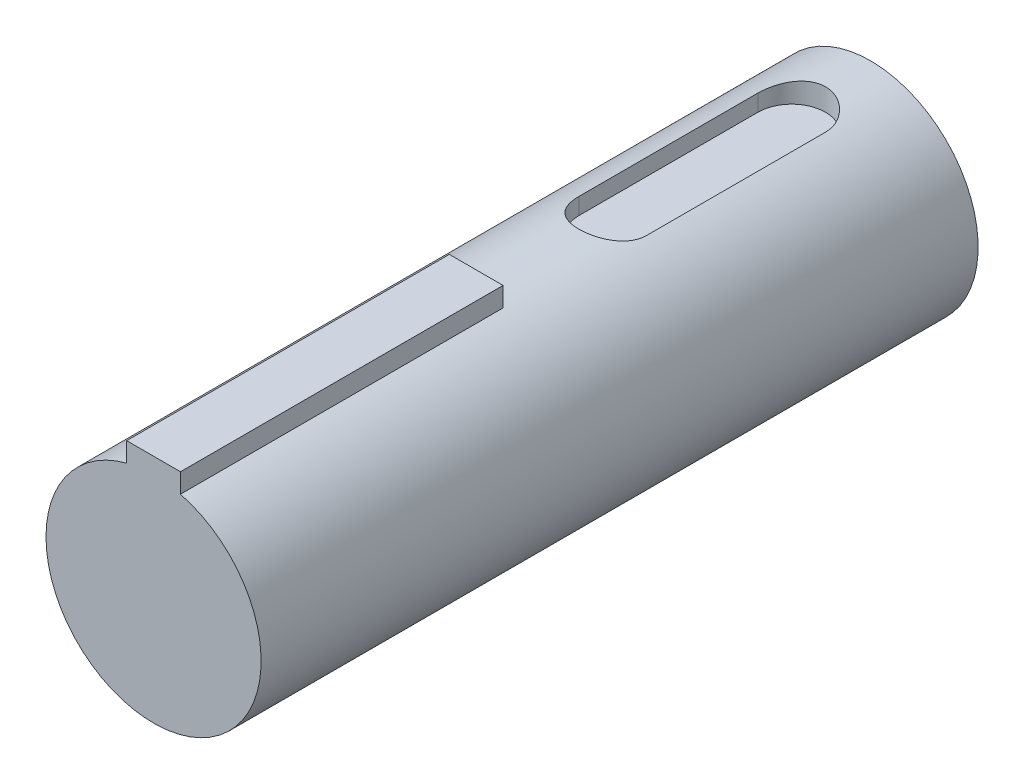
ISO-10303-21;
HEADER;
FILE_DESCRIPTION(('STEP AP214'),'2;1');
FILE_NAME('part.step','',(''),(''),'','','');
FILE_SCHEMA(('AUTOMOTIVE_DESIGN { 1 0 10303 214 1 1 1 1 }'));
ENDSEC;
DATA;
#1=APPLICATION_CONTEXT('core data for automotive mechanical design processes');
#2=APPLICATION_PROTOCOL_DEFINITION('international standard','automotive_design',2000,#1);
#3=PRODUCT_CONTEXT('',#1,'mechanical');
#4=PRODUCT('Part','Part','',(#3));
#5=PRODUCT_RELATED_PRODUCT_CATEGORY('part','',(#4));
#6=PRODUCT_DEFINITION_FORMATION('','',#4);
#7=PRODUCT_DEFINITION_CONTEXT('part definition',#1,'design');
#8=PRODUCT_DEFINITION('design','',#6,#7);
#9=PRODUCT_DEFINITION_SHAPE('','',#8);
#10=(LENGTH_UNIT() NAMED_UNIT(*) SI_UNIT(.MILLI.,.METRE.));
#11=(NAMED_UNIT(*) PLANE_ANGLE_UNIT() SI_UNIT($,.RADIAN.));
#12=(NAMED_UNIT(*) SI_UNIT($,.STERADIAN.) SOLID_ANGLE_UNIT());
#13=UNCERTAINTY_MEASURE_WITH_UNIT(LENGTH_MEASURE(1.E-05),#10,'distance_accuracy_value','');
#14=(GEOMETRIC_REPRESENTATION_CONTEXT(3) GLOBAL_UNCERTAINTY_ASSIGNED_CONTEXT((#13)) GLOBAL_UNIT_ASSIGNED_CONTEXT((#10,
#11,#12)) REPRESENTATION_CONTEXT('',''));
#15=CARTESIAN_POINT('',(0.,0.,0.));
#16=DIRECTION('',(0.,0.,1.));
#17=DIRECTION('',(1.,0.,0.));
#18=AXIS2_PLACEMENT_3D('',#15,#16,#17);
#19=CARTESIAN_POINT('',(0.,0.,28.575));
#20=DIRECTION('',(0.,0.,-1.));
#21=DIRECTION('',(-1.,0.,0.));
#22=AXIS2_PLACEMENT_3D('',#19,#20,#21);
#23=CYLINDRICAL_SURFACE('',#22,9.525);
#24=CARTESIAN_POINT('',(0.,0.,-34.925));
#25=DIRECTION('',(0.,0.,-1.));
#26=DIRECTION('',(-1.,0.,0.));
#27=AXIS2_PLACEMENT_3D('',#24,#25,#26);
#28=CIRCLE('',#27,9.525);
#29=CARTESIAN_POINT('',(-9.525,0.,-34.925));
#30=VERTEX_POINT('',#29);
#31=EDGE_CURVE('E162',#30,#30,#28,.T.);
#32=ORIENTED_EDGE('',*,*,#31,.F.);
#33=EDGE_LOOP('',(#32));
#34=FACE_BOUND('',#33,.T.);
#35=DIRECTION('',(0.,0.,-1.));
#36=VECTOR('',#35,1.);
#37=CARTESIAN_POINT('',(-2.38125,9.22254159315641,28.575));
#38=LINE('',#37,#36);
#39=CARTESIAN_POINT('',(-2.38125,9.22254159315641,28.575));
#40=VERTEX_POINT('',#39);
#41=CARTESIAN_POINT('',(-2.38125,9.22254159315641,0.));
#42=VERTEX_POINT('',#41);
#43=EDGE_CURVE('E180',#40,#42,#38,.T.);
#44=ORIENTED_EDGE('',*,*,#43,.T.);
#45=CARTESIAN_POINT('',(0.,0.,0.));
#46=DIRECTION('',(0.,0.,-1.));
#47=DIRECTION('',(-1.,0.,0.));
#48=AXIS2_PLACEMENT_3D('',#45,#46,#47);
#49=CIRCLE('',#48,9.525);
#50=CARTESIAN_POINT('',(2.38125,9.22254159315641,0.));
#51=VERTEX_POINT('',#50);
#52=EDGE_CURVE('E132',#42,#51,#49,.T.);
#53=ORIENTED_EDGE('',*,*,#52,.T.);
#54=DIRECTION('',(0.,0.,-1.));
#55=VECTOR('',#54,1.);
#56=CARTESIAN_POINT('',(2.38125,9.22254159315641,28.575));
#57=LINE('',#56,#55);
#58=CARTESIAN_POINT('',(2.38125,9.22254159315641,28.575));
#59=VERTEX_POINT('',#58);
#60=EDGE_CURVE('E197',#59,#51,#57,.T.);
#61=ORIENTED_EDGE('',*,*,#60,.F.);
#62=CARTESIAN_POINT('',(0.,0.,28.575));
#63=DIRECTION('',(0.,0.,1.));
#64=DIRECTION('',(1.,0.,0.));
#65=AXIS2_PLACEMENT_3D('',#62,#63,#64);
#66=CIRCLE('',#65,9.525);
#67=EDGE_CURVE('E169',#40,#59,#66,.T.);
#68=ORIENTED_EDGE('',*,*,#67,.F.);
#69=EDGE_LOOP('',(#44,#53,#61,#68));
#70=FACE_BOUND('',#69,.T.);
#71=CARTESIAN_POINT('',(2.9972,9.041151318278,-27.94));
#72=CARTESIAN_POINT('',(2.99721048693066,9.04113917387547,-28.0220512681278));
#73=CARTESIAN_POINT('',(2.99383086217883,9.04226799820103,-28.1040956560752));
#74=CARTESIAN_POINT('',(2.9803730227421,9.04671726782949,-28.2675539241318));
#75=CARTESIAN_POINT('',(2.97029644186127,9.05003717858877,-28.348967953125));
#76=CARTESIAN_POINT('',(2.94356252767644,9.05876654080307,-28.5103703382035));
#77=CARTESIAN_POINT('',(2.9269231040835,9.06417030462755,-28.5903619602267));
#78=CARTESIAN_POINT('',(2.88722986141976,9.07689155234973,-28.7485611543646));
#79=CARTESIAN_POINT('',(2.86417584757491,9.08420909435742,-28.8267686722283));
#80=CARTESIAN_POINT('',(2.78568484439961,9.10871154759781,-29.0578382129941));
#81=CARTESIAN_POINT('',(2.72088210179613,9.12845907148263,-29.2073668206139));
#82=CARTESIAN_POINT('',(2.56834119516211,9.17254136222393,-29.4934395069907));
#83=CARTESIAN_POINT('',(2.48059089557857,9.19687855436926,-29.6299766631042));
#84=CARTESIAN_POINT('',(2.28137707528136,9.24834222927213,-29.8909733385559));
#85=CARTESIAN_POINT('',(2.16925559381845,9.27553229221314,-30.0149191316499));
#86=CARTESIAN_POINT('',(1.92588986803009,9.32909841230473,-30.2425932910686));
#87=CARTESIAN_POINT('',(1.79464232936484,9.35547432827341,-30.3463181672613));
#88=CARTESIAN_POINT('',(1.51302443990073,9.40517197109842,-30.5329003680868));
#89=CARTESIAN_POINT('',(1.36228410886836,9.42840963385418,-30.6152236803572));
#90=CARTESIAN_POINT('',(1.04824759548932,9.46846410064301,-30.7531429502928));
#91=CARTESIAN_POINT('',(0.884954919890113,9.48528269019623,-30.8087463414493));
#92=CARTESIAN_POINT('',(0.555861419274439,9.51015297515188,-30.8899226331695));
#93=CARTESIAN_POINT('',(0.390298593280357,9.51846230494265,-30.9163800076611));
#94=CARTESIAN_POINT('',(0.0568858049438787,9.52628831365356,-30.9413166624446));
#95=CARTESIAN_POINT('',(-0.110963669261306,9.5258068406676,-30.9398018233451));
#96=CARTESIAN_POINT('',(-0.437950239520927,9.51628404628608,-30.9094157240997));
#97=CARTESIAN_POINT('',(-0.597186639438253,9.50754294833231,-30.881503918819));
#98=CARTESIAN_POINT('',(-0.908586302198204,9.48285325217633,-30.800692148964));
#99=CARTESIAN_POINT('',(-1.06074918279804,9.46690426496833,-30.747790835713));
#100=CARTESIAN_POINT('',(-1.35588769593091,9.42918977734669,-30.6178906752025));
#101=CARTESIAN_POINT('',(-1.49872666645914,9.40735487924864,-30.5406023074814));
#102=CARTESIAN_POINT('',(-1.76970329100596,9.36016668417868,-30.3643551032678));
#103=CARTESIAN_POINT('',(-1.89783732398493,9.33481252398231,-30.2653909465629));
#104=CARTESIAN_POINT('',(-2.14147672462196,9.28202044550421,-30.0436969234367));
#105=CARTESIAN_POINT('',(-2.25622246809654,9.25453974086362,-29.9201413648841));
#106=CARTESIAN_POINT('',(-2.46361511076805,9.20150624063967,-29.6552563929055));
#107=CARTESIAN_POINT('',(-2.55625530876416,9.17595403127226,-29.5139216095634));
#108=CARTESIAN_POINT('',(-2.71772114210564,9.12944610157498,-29.2152902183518));
#109=CARTESIAN_POINT('',(-2.78624804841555,9.10854914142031,-29.057822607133));
#110=CARTESIAN_POINT('',(-2.89549150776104,9.07441913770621,-28.7328493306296));
#111=CARTESIAN_POINT('',(-2.93625111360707,9.06117423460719,-28.5653596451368));
#112=CARTESIAN_POINT('',(-2.97396683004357,9.04882670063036,-28.3202271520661));
#113=CARTESIAN_POINT('',(-2.9826772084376,9.045955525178,-28.244420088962));
#114=CARTESIAN_POINT('',(-2.99428915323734,9.04211715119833,-28.0924217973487));
#115=CARTESIAN_POINT('',(-2.9971988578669,9.04114728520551,-28.0162312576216));
#116=CARTESIAN_POINT('',(-2.9972,9.041151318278,-27.94));
#117=B_SPLINE_CURVE_WITH_KNOTS('',3,(#71,#72,#73,#74,#75,#76,#77,#78,#79,#80,#81,#82,#83,#84,
#85,#86,#87,#88,#89,#90,#91,#92,#93,#94,#95,#96,#97,#98,#99,#100,#101,#102,#103,#104,#105,#106,
#107,#108,#109,#110,#111,#112,#113,#114,#115,#116),.UNSPECIFIED.,.F.,.F.,(4,2,2,2,2,2,2,2,2,2,2,
2,2,2,2,2,2,2,2,2,2,2,4),(0.,0.246064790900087,0.492069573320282,0.737407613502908,
0.98275310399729,1.47278341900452,1.963073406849,2.46875537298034,2.97452454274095,
3.49191038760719,4.00915221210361,4.51022397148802,5.01119039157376,5.49462071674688,
5.978077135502,6.4675039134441,6.95705095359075,7.46722571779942,7.97755494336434,
8.49400055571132,9.00964359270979,9.23851681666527,9.46706870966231),.UNSPECIFIED.);
#118=CARTESIAN_POINT('',(2.9972,9.04115131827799,-27.94));
#119=VERTEX_POINT('',#118);
#120=CARTESIAN_POINT('',(-2.9972,9.04115131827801,-27.94));
#121=VERTEX_POINT('',#120);
#122=EDGE_CURVE('E11',#119,#121,#117,.T.);
#123=ORIENTED_EDGE('',*,*,#122,.F.);
#124=DIRECTION('',(0.,0.,-1.));
#125=VECTOR('',#124,1.);
#126=CARTESIAN_POINT('',(2.99720000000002,9.04115131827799,28.575));
#127=LINE('',#126,#125);
#128=CARTESIAN_POINT('',(2.99720000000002,9.04115131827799,-12.0904));
#129=VERTEX_POINT('',#128);
#130=EDGE_CURVE('E200',#129,#119,#127,.T.);
#131=ORIENTED_EDGE('',*,*,#130,.F.);
#132=CARTESIAN_POINT('',(-2.99719999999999,9.041151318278,-12.0904));
#133=CARTESIAN_POINT('',(-2.99721048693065,9.04113917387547,-12.0083487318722));
#134=CARTESIAN_POINT('',(-2.99383086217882,9.04226799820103,-11.9263043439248));
#135=CARTESIAN_POINT('',(-2.98037302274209,9.04671726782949,-11.7628460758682));
#136=CARTESIAN_POINT('',(-2.97029644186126,9.05003717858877,-11.681432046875));
#137=CARTESIAN_POINT('',(-2.94356252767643,9.05876654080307,-11.5200296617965));
#138=CARTESIAN_POINT('',(-2.92692310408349,9.06417030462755,-11.4400380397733));
#139=CARTESIAN_POINT('',(-2.88722986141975,9.07689155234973,-11.2818388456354));
#140=CARTESIAN_POINT('',(-2.8641758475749,9.08420909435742,-11.2036313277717));
#141=CARTESIAN_POINT('',(-2.7856848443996,9.10871154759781,-10.9725617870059));
#142=CARTESIAN_POINT('',(-2.72088210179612,9.12845907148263,-10.8230331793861));
#143=CARTESIAN_POINT('',(-2.5683411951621,9.17254136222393,-10.5369604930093));
#144=CARTESIAN_POINT('',(-2.48059089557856,9.19687855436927,-10.4004233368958));
#145=CARTESIAN_POINT('',(-2.28137707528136,9.24834222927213,-10.1394266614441));
#146=CARTESIAN_POINT('',(-2.16925559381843,9.27553229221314,-10.0154808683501));
#147=CARTESIAN_POINT('',(-1.92588986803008,9.32909841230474,-9.78780670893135));
#148=CARTESIAN_POINT('',(-1.79464232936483,9.35547432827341,-9.6840818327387));
#149=CARTESIAN_POINT('',(-1.51302443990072,9.40517197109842,-9.49749963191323));
#150=CARTESIAN_POINT('',(-1.36228410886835,9.42840963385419,-9.41517631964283));
#151=CARTESIAN_POINT('',(-1.04824759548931,9.46846410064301,-9.27725704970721));
#152=CARTESIAN_POINT('',(-0.8849549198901,9.48528269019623,-9.22165365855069));
#153=CARTESIAN_POINT('',(-0.555861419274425,9.51015297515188,-9.14047736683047));
#154=CARTESIAN_POINT('',(-0.390298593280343,9.51846230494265,-9.11401999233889));
#155=CARTESIAN_POINT('',(-0.0568858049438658,9.52628831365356,-9.08908333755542));
#156=CARTESIAN_POINT('',(0.110963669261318,9.5258068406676,-9.0905981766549));
#157=CARTESIAN_POINT('',(0.437950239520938,9.51628404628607,-9.12098427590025));
#158=CARTESIAN_POINT('',(0.597186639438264,9.50754294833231,-9.14889608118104));
#159=CARTESIAN_POINT('',(0.908586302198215,9.48285325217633,-9.229707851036));
#160=CARTESIAN_POINT('',(1.06074918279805,9.46690426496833,-9.28260916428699));
#161=CARTESIAN_POINT('',(1.35588769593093,9.42918977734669,-9.41250932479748));
#162=CARTESIAN_POINT('',(1.49872666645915,9.40735487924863,-9.48979769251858));
#163=CARTESIAN_POINT('',(1.76970329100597,9.36016668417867,-9.66604489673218));
#164=CARTESIAN_POINT('',(1.89783732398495,9.33481252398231,-9.76500905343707));
#165=CARTESIAN_POINT('',(2.14147672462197,9.28202044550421,-9.98670307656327));
#166=CARTESIAN_POINT('',(2.25622246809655,9.25453974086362,-10.1102586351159));
#167=CARTESIAN_POINT('',(2.46361511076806,9.20150624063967,-10.3751436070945));
#168=CARTESIAN_POINT('',(2.55625530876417,9.17595403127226,-10.5164783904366));
#169=CARTESIAN_POINT('',(2.71772114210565,9.12944610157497,-10.8151097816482));
#170=CARTESIAN_POINT('',(2.78624804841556,9.1085491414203,-10.972577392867));
#171=CARTESIAN_POINT('',(2.89549150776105,9.0744191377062,-11.2975506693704));
#172=CARTESIAN_POINT('',(2.93625111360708,9.06117423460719,-11.4650403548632));
#173=CARTESIAN_POINT('',(2.97396683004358,9.04882670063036,-11.7101728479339));
#174=CARTESIAN_POINT('',(2.98267720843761,9.045955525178,-11.785979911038));
#175=CARTESIAN_POINT('',(2.99428915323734,9.04211715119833,-11.9379782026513));
#176=CARTESIAN_POINT('',(2.99719885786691,9.0411472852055,-12.0141687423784));
#177=CARTESIAN_POINT('',(2.99720000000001,9.041151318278,-12.0904));
#178=B_SPLINE_CURVE_WITH_KNOTS('',3,(#132,#133,#134,#135,#136,#137,#138,#139,#140,#141,#142,
#143,#144,#145,#146,#147,#148,#149,#150,#151,#152,#153,#154,#155,#156,#157,#158,#159,#160,#161,
#162,#163,#164,#165,#166,#167,#168,#169,#170,#171,#172,#173,#174,#175,#176,#177),.UNSPECIFIED.,
.F.,.F.,(4,2,2,2,2,2,2,2,2,2,2,2,2,2,2,2,2,2,2,2,2,2,4),(0.,0.246064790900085,0.492069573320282,
0.737407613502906,0.982753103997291,1.47278341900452,1.963073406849,2.46875537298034,
2.97452454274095,3.4919103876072,4.00915221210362,4.51022397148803,5.01119039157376,
5.49462071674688,5.978077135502,6.4675039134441,6.95705095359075,7.46722571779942,
7.97755494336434,8.49400055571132,9.0096435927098,9.23851681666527,9.46706870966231),.UNSPECIFIED.);
#179=CARTESIAN_POINT('',(-2.99719999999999,9.041151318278,-12.0904));
#180=VERTEX_POINT('',#179);
#181=EDGE_CURVE('E203',#180,#129,#178,.T.);
#182=ORIENTED_EDGE('',*,*,#181,.F.);
#183=DIRECTION('',(0.,0.,-1.));
#184=VECTOR('',#183,1.);
#185=CARTESIAN_POINT('',(-2.99719999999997,9.04115131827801,28.575));
#186=LINE('',#185,#184);
#187=EDGE_CURVE('E55',#121,#180,#186,.F.);
#188=ORIENTED_EDGE('',*,*,#187,.F.);
#189=EDGE_LOOP('',(#123,#131,#182,#188));
#190=FACE_BOUND('',#189,.T.);
#191=ADVANCED_FACE('F41',(#34,#70,#190),#23,.T.);
#192=CARTESIAN_POINT('',(0.,0.,0.));
#193=DIRECTION('',(0.,0.,1.));
#194=DIRECTION('',(1.,0.,0.));
#195=AXIS2_PLACEMENT_3D('',#192,#193,#194);
#196=PLANE('',#195);
#197=ORIENTED_EDGE('',*,*,#52,.F.);
#198=DIRECTION('',(0.,-1.,0.));
#199=VECTOR('',#198,1.);
#200=CARTESIAN_POINT('',(-2.38125,10.9473999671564,0.));
#201=LINE('',#200,#199);
#202=CARTESIAN_POINT('',(-2.38125,10.9473999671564,0.));
#203=VERTEX_POINT('',#202);
#204=EDGE_CURVE('E172',#203,#42,#201,.T.);
#205=ORIENTED_EDGE('',*,*,#204,.F.);
#206=DIRECTION('',(-1.,0.,0.));
#207=VECTOR('',#206,1.);
#208=CARTESIAN_POINT('',(-2.38125,10.9473999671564,0.));
#209=LINE('',#208,#207);
#210=CARTESIAN_POINT('',(2.38125,10.9473999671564,0.));
#211=VERTEX_POINT('',#210);
#212=EDGE_CURVE('E90',#211,#203,#209,.T.);
#213=ORIENTED_EDGE('',*,*,#212,.F.);
#214=DIRECTION('',(0.,1.,0.));
#215=VECTOR('',#214,1.);
#216=CARTESIAN_POINT('',(2.38125,10.9473999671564,0.));
#217=LINE('',#216,#215);
#218=EDGE_CURVE('E166',#51,#211,#217,.T.);
#219=ORIENTED_EDGE('',*,*,#218,.F.);
#220=EDGE_LOOP('',(#197,#205,#213,#219));
#221=FACE_BOUND('',#220,.T.);
#222=ADVANCED_FACE('F230',(#221),#196,.F.);
#223=CARTESIAN_POINT('',(2.38125,10.9473999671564,28.575));
#224=DIRECTION('',(-1.,0.,0.));
#225=DIRECTION('',(0.,-1.,0.));
#226=AXIS2_PLACEMENT_3D('',#223,#224,#225);
#227=PLANE('',#226);
#228=ORIENTED_EDGE('',*,*,#218,.T.);
#229=DIRECTION('',(0.,0.,-1.));
#230=VECTOR('',#229,1.);
#231=CARTESIAN_POINT('',(2.38125,10.9473999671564,28.575));
#232=LINE('',#231,#230);
#233=CARTESIAN_POINT('',(2.38125,10.9473999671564,28.575));
#234=VERTEX_POINT('',#233);
#235=EDGE_CURVE('E194',#234,#211,#232,.T.);
#236=ORIENTED_EDGE('',*,*,#235,.F.);
#237=DIRECTION('',(0.,1.,0.));
#238=VECTOR('',#237,1.);
#239=CARTESIAN_POINT('',(2.38125,10.9473999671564,28.575));
#240=LINE('',#239,#238);
#241=EDGE_CURVE('E98',#59,#234,#240,.T.);
#242=ORIENTED_EDGE('',*,*,#241,.F.);
#243=ORIENTED_EDGE('',*,*,#60,.T.);
#244=EDGE_LOOP('',(#228,#236,#242,#243));
#245=FACE_BOUND('',#244,.T.);
#246=ADVANCED_FACE('F233',(#245),#227,.F.);
#247=CARTESIAN_POINT('',(-2.38125,10.9473999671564,28.575));
#248=DIRECTION('',(0.,-1.,0.));
#249=DIRECTION('',(1.,0.,0.));
#250=AXIS2_PLACEMENT_3D('',#247,#248,#249);
#251=PLANE('',#250);
#252=ORIENTED_EDGE('',*,*,#212,.T.);
#253=DIRECTION('',(0.,0.,-1.));
#254=VECTOR('',#253,1.);
#255=CARTESIAN_POINT('',(-2.38125,10.9473999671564,28.575));
#256=LINE('',#255,#254);
#257=CARTESIAN_POINT('',(-2.38125,10.9473999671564,28.575));
#258=VERTEX_POINT('',#257);
#259=EDGE_CURVE('E191',#258,#203,#256,.T.);
#260=ORIENTED_EDGE('',*,*,#259,.F.);
#261=DIRECTION('',(-1.,0.,0.));
#262=VECTOR('',#261,1.);
#263=CARTESIAN_POINT('',(-2.38125,10.9473999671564,28.575));
#264=LINE('',#263,#262);
#265=EDGE_CURVE('E175',#234,#258,#264,.T.);
#266=ORIENTED_EDGE('',*,*,#265,.F.);
#267=ORIENTED_EDGE('',*,*,#235,.T.);
#268=EDGE_LOOP('',(#252,#260,#266,#267));
#269=FACE_BOUND('',#268,.T.);
#270=ADVANCED_FACE('F237',(#269),#251,.F.);
#271=CARTESIAN_POINT('',(-2.38125,10.9473999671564,28.575));
#272=DIRECTION('',(1.,0.,0.));
#273=DIRECTION('',(0.,1.,0.));
#274=AXIS2_PLACEMENT_3D('',#271,#272,#273);
#275=PLANE('',#274);
#276=ORIENTED_EDGE('',*,*,#204,.T.);
#277=ORIENTED_EDGE('',*,*,#43,.F.);
#278=DIRECTION('',(0.,-1.,0.));
#279=VECTOR('',#278,1.);
#280=CARTESIAN_POINT('',(-2.38125,10.9473999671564,28.575));
#281=LINE('',#280,#279);
#282=EDGE_CURVE('E71',#258,#40,#281,.T.);
#283=ORIENTED_EDGE('',*,*,#282,.F.);
#284=ORIENTED_EDGE('',*,*,#259,.T.);
#285=EDGE_LOOP('',(#276,#277,#283,#284));
#286=FACE_BOUND('',#285,.T.);
#287=ADVANCED_FACE('F229',(#286),#275,.F.);
#288=CARTESIAN_POINT('',(0.,0.,28.575));
#289=DIRECTION('',(0.,0.,1.));
#290=DIRECTION('',(1.,0.,0.));
#291=AXIS2_PLACEMENT_3D('',#288,#289,#290);
#292=PLANE('',#291);
#293=ORIENTED_EDGE('',*,*,#67,.T.);
#294=ORIENTED_EDGE('',*,*,#241,.T.);
#295=ORIENTED_EDGE('',*,*,#265,.T.);
#296=ORIENTED_EDGE('',*,*,#282,.T.);
#297=EDGE_LOOP('',(#293,#294,#295,#296));
#298=FACE_BOUND('',#297,.T.);
#299=ADVANCED_FACE('F225',(#298),#292,.T.);
#300=CARTESIAN_POINT('',(0.,0.,-34.925));
#301=DIRECTION('',(0.,0.,-1.));
#302=DIRECTION('',(-1.,0.,0.));
#303=AXIS2_PLACEMENT_3D('',#300,#301,#302);
#304=PLANE('',#303);
#305=ORIENTED_EDGE('',*,*,#31,.T.);
#306=EDGE_LOOP('',(#305));
#307=FACE_BOUND('',#306,.T.);
#308=ADVANCED_FACE('F222',(#307),#304,.T.);
#309=CARTESIAN_POINT('',(0.,10.0584,-27.94));
#310=DIRECTION('',(0.,-1.,0.));
#311=DIRECTION('',(0.,0.,-1.));
#312=AXIS2_PLACEMENT_3D('',#309,#310,#311);
#313=CYLINDRICAL_SURFACE('',#312,2.9972);
#314=ORIENTED_EDGE('',*,*,#122,.T.);
#315=DIRECTION('',(0.,-1.,0.));
#316=VECTOR('',#315,1.);
#317=CARTESIAN_POINT('',(-2.9972,10.0584,-27.94));
#318=LINE('',#317,#316);
#319=CARTESIAN_POINT('',(-2.9972,7.5692,-27.94));
#320=VERTEX_POINT('',#319);
#321=EDGE_CURVE('E122',#121,#320,#318,.T.);
#322=ORIENTED_EDGE('',*,*,#321,.T.);
#323=CARTESIAN_POINT('',(0.,7.5692,-27.94));
#324=DIRECTION('',(0.,1.,0.));
#325=DIRECTION('',(0.,0.,1.));
#326=AXIS2_PLACEMENT_3D('',#323,#324,#325);
#327=CIRCLE('',#326,2.9972);
#328=CARTESIAN_POINT('',(2.9972,7.5692,-27.94));
#329=VERTEX_POINT('',#328);
#330=EDGE_CURVE('E127',#329,#320,#327,.T.);
#331=ORIENTED_EDGE('',*,*,#330,.F.);
#332=DIRECTION('',(0.,-1.,0.));
#333=VECTOR('',#332,1.);
#334=CARTESIAN_POINT('',(2.9972,10.0584,-27.94));
#335=LINE('',#334,#333);
#336=EDGE_CURVE('E155',#119,#329,#335,.T.);
#337=ORIENTED_EDGE('',*,*,#336,.F.);
#338=EDGE_LOOP('',(#314,#322,#331,#337));
#339=FACE_BOUND('',#338,.T.);
#340=ADVANCED_FACE('F124',(#339),#313,.F.);
#341=CARTESIAN_POINT('',(-2.9972,10.0584,-27.94));
#342=DIRECTION('',(1.,0.,0.));
#343=DIRECTION('',(0.,0.,-1.));
#344=AXIS2_PLACEMENT_3D('',#341,#342,#343);
#345=PLANE('',#344);
#346=ORIENTED_EDGE('',*,*,#187,.T.);
#347=DIRECTION('',(0.,-1.,0.));
#348=VECTOR('',#347,1.);
#349=CARTESIAN_POINT('',(-2.99719999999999,10.0584,-12.0904));
#350=LINE('',#349,#348);
#351=CARTESIAN_POINT('',(-2.99719999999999,7.5692,-12.0904));
#352=VERTEX_POINT('',#351);
#353=EDGE_CURVE('E133',#180,#352,#350,.T.);
#354=ORIENTED_EDGE('',*,*,#353,.T.);
#355=DIRECTION('',(0.,0.,1.));
#356=VECTOR('',#355,1.);
#357=CARTESIAN_POINT('',(-2.9972,7.5692,-27.94));
#358=LINE('',#357,#356);
#359=EDGE_CURVE('E136',#320,#352,#358,.T.);
#360=ORIENTED_EDGE('',*,*,#359,.F.);
#361=ORIENTED_EDGE('',*,*,#321,.F.);
#362=EDGE_LOOP('',(#346,#354,#360,#361));
#363=FACE_BOUND('',#362,.T.);
#364=ADVANCED_FACE('F137',(#363),#345,.T.);
#365=CARTESIAN_POINT('',(0.,10.0584,-12.0904));
#366=DIRECTION('',(0.,-1.,0.));
#367=DIRECTION('',(0.,0.,-1.));
#368=AXIS2_PLACEMENT_3D('',#365,#366,#367);
#369=CYLINDRICAL_SURFACE('',#368,2.9972);
#370=ORIENTED_EDGE('',*,*,#181,.T.);
#371=DIRECTION('',(0.,-1.,0.));
#372=VECTOR('',#371,1.);
#373=CARTESIAN_POINT('',(2.99720000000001,10.0584,-12.0904));
#374=LINE('',#373,#372);
#375=CARTESIAN_POINT('',(2.99720000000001,7.5692,-12.0904));
#376=VERTEX_POINT('',#375);
#377=EDGE_CURVE('E62',#129,#376,#374,.T.);
#378=ORIENTED_EDGE('',*,*,#377,.T.);
#379=CARTESIAN_POINT('',(0.,7.5692,-12.0904));
#380=DIRECTION('',(0.,1.,0.));
#381=DIRECTION('',(0.,0.,1.));
#382=AXIS2_PLACEMENT_3D('',#379,#380,#381);
#383=CIRCLE('',#382,2.9972);
#384=EDGE_CURVE('E143',#352,#376,#383,.T.);
#385=ORIENTED_EDGE('',*,*,#384,.F.);
#386=ORIENTED_EDGE('',*,*,#353,.F.);
#387=EDGE_LOOP('',(#370,#378,#385,#386));
#388=FACE_BOUND('',#387,.T.);
#389=ADVANCED_FACE('F210',(#388),#369,.F.);
#390=CARTESIAN_POINT('',(2.9972,10.0584,-27.94));
#391=DIRECTION('',(-1.,0.,0.));
#392=DIRECTION('',(0.,0.,1.));
#393=AXIS2_PLACEMENT_3D('',#390,#391,#392);
#394=PLANE('',#393);
#395=ORIENTED_EDGE('',*,*,#130,.T.);
#396=ORIENTED_EDGE('',*,*,#336,.T.);
#397=DIRECTION('',(0.,0.,-1.));
#398=VECTOR('',#397,1.);
#399=CARTESIAN_POINT('',(2.9972,7.5692,-27.94));
#400=LINE('',#399,#398);
#401=EDGE_CURVE('E147',#376,#329,#400,.T.);
#402=ORIENTED_EDGE('',*,*,#401,.F.);
#403=ORIENTED_EDGE('',*,*,#377,.F.);
#404=EDGE_LOOP('',(#395,#396,#402,#403));
#405=FACE_BOUND('',#404,.T.);
#406=ADVANCED_FACE('F215',(#405),#394,.T.);
#407=CARTESIAN_POINT('',(0.,7.5692,-27.94));
#408=DIRECTION('',(0.,1.,0.));
#409=DIRECTION('',(0.,0.,1.));
#410=AXIS2_PLACEMENT_3D('',#407,#408,#409);
#411=PLANE('',#410);
#412=ORIENTED_EDGE('',*,*,#330,.T.);
#413=ORIENTED_EDGE('',*,*,#359,.T.);
#414=ORIENTED_EDGE('',*,*,#384,.T.);
#415=ORIENTED_EDGE('',*,*,#401,.T.);
#416=EDGE_LOOP('',(#412,#413,#414,#415));
#417=FACE_BOUND('',#416,.T.);
#418=ADVANCED_FACE('F146',(#417),#411,.T.);
#419=CLOSED_SHELL('',(#191,#222,#246,#270,#287,#299,#308,#340,#364,#389,#406,#418));
#420=MANIFOLD_SOLID_BREP('B2',#419);
#421=ADVANCED_BREP_SHAPE_REPRESENTATION('',(#18,#420),#14);
#422=SHAPE_DEFINITION_REPRESENTATION(#9,#421);
ENDSEC;
END-ISO-10303-21;
